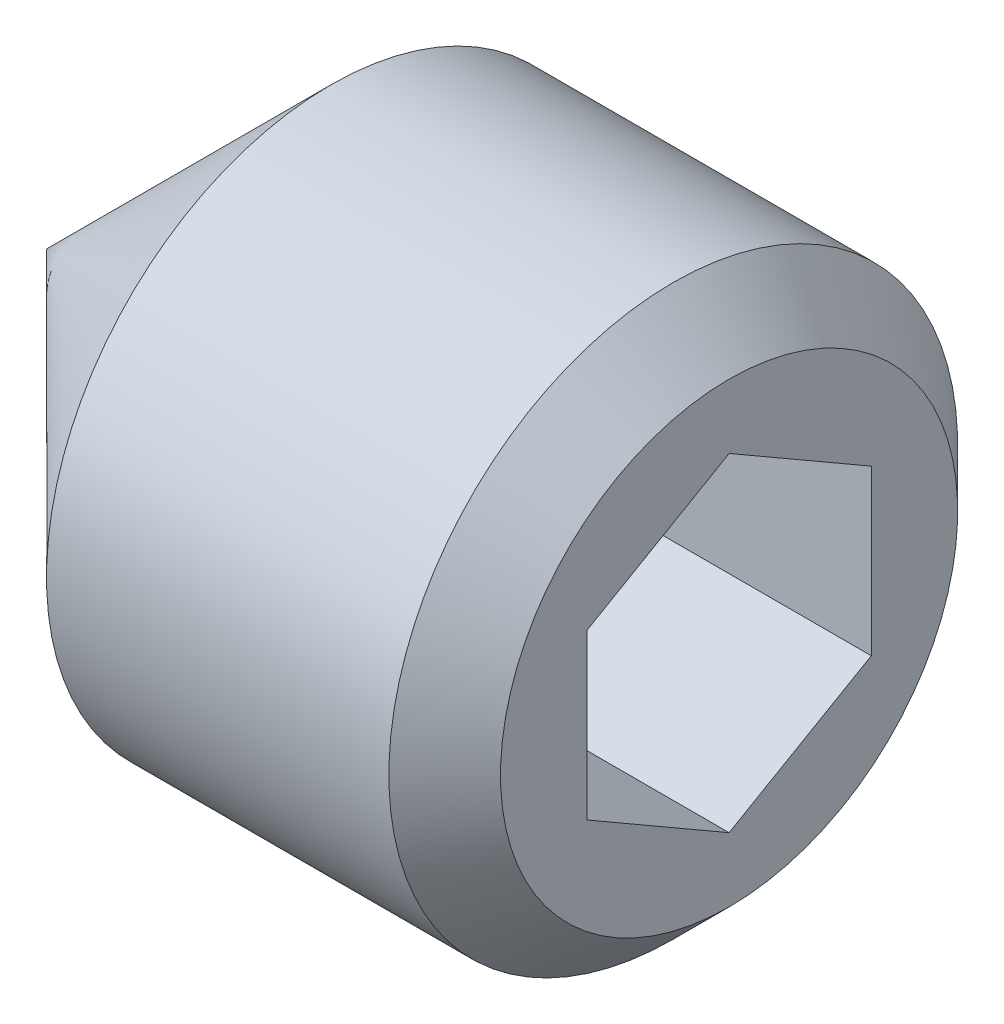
ISO-10303-21;
HEADER;
FILE_DESCRIPTION(('STEP AP214'),'2;1');
FILE_NAME('part.step','',(''),(''),'','','');
FILE_SCHEMA(('AUTOMOTIVE_DESIGN { 1 0 10303 214 1 1 1 1 }'));
ENDSEC;
DATA;
#1=APPLICATION_CONTEXT('core data for automotive mechanical design processes');
#2=APPLICATION_PROTOCOL_DEFINITION('international standard','automotive_design',2000,#1);
#3=PRODUCT_CONTEXT('',#1,'mechanical');
#4=PRODUCT('Part','Part','',(#3));
#5=PRODUCT_RELATED_PRODUCT_CATEGORY('part','',(#4));
#6=PRODUCT_DEFINITION_FORMATION('','',#4);
#7=PRODUCT_DEFINITION_CONTEXT('part definition',#1,'design');
#8=PRODUCT_DEFINITION('design','',#6,#7);
#9=PRODUCT_DEFINITION_SHAPE('','',#8);
#10=(LENGTH_UNIT() NAMED_UNIT(*) SI_UNIT(.MILLI.,.METRE.));
#11=(NAMED_UNIT(*) PLANE_ANGLE_UNIT() SI_UNIT($,.RADIAN.));
#12=(NAMED_UNIT(*) SI_UNIT($,.STERADIAN.) SOLID_ANGLE_UNIT());
#13=UNCERTAINTY_MEASURE_WITH_UNIT(LENGTH_MEASURE(1.E-05),#10,'distance_accuracy_value','');
#14=(GEOMETRIC_REPRESENTATION_CONTEXT(3) GLOBAL_UNCERTAINTY_ASSIGNED_CONTEXT((#13)) GLOBAL_UNIT_ASSIGNED_CONTEXT((#10,
#11,#12)) REPRESENTATION_CONTEXT('',''));
#15=CARTESIAN_POINT('',(0.,0.,0.));
#16=DIRECTION('',(0.,0.,1.));
#17=DIRECTION('',(1.,0.,0.));
#18=AXIS2_PLACEMENT_3D('',#15,#16,#17);
#19=CARTESIAN_POINT('',(5.99999999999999,-0.721687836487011,-1.25));
#20=DIRECTION('',(0.,0.,-1.));
#21=DIRECTION('',(-1.,0.,0.));
#22=AXIS2_PLACEMENT_3D('',#19,#20,#21);
#23=PLANE('',#22);
#24=DIRECTION('',(1.,0.,0.));
#25=VECTOR('',#24,1.);
#26=CARTESIAN_POINT('',(5.99999999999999,-0.721687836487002,-1.25000000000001));
#27=LINE('',#26,#25);
#28=CARTESIAN_POINT('',(3.00000000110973,-0.721687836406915,-1.24999999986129));
#29=VERTEX_POINT('',#28);
#30=CARTESIAN_POINT('',(5.99999999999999,-0.721687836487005,-1.25000000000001));
#31=VERTEX_POINT('',#30);
#32=EDGE_CURVE('E77',#29,#31,#27,.T.);
#33=ORIENTED_EDGE('',*,*,#32,.T.);
#34=DIRECTION('',(0.,1.,0.));
#35=VECTOR('',#34,1.);
#36=CARTESIAN_POINT('',(5.99999999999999,-0.721687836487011,-1.25));
#37=LINE('',#36,#35);
#38=CARTESIAN_POINT('',(5.99999999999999,0.721687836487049,-1.25));
#39=VERTEX_POINT('',#38);
#40=EDGE_CURVE('E83',#39,#31,#37,.F.);
#41=ORIENTED_EDGE('',*,*,#40,.F.);
#42=DIRECTION('',(1.,0.,0.));
#43=VECTOR('',#42,1.);
#44=CARTESIAN_POINT('',(5.99999999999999,0.721687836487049,-1.25));
#45=LINE('',#44,#43);
#46=CARTESIAN_POINT('',(3.00000000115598,0.721687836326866,-1.25));
#47=VERTEX_POINT('',#46);
#48=EDGE_CURVE('E80',#39,#47,#45,.F.);
#49=ORIENTED_EDGE('',*,*,#48,.T.);
#50=CARTESIAN_POINT('',(3.00000000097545,-0.72168783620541,-1.25000000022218));
#51=CARTESIAN_POINT('',(2.98168471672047,-0.658260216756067,-1.2500000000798));
#52=CARTESIAN_POINT('',(2.96502792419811,-0.594285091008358,-1.25000000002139));
#53=CARTESIAN_POINT('',(2.93595399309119,-0.465227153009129,-1.24999999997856));
#54=CARTESIAN_POINT('',(2.9235471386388,-0.400142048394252,-1.24999999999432));
#55=CARTESIAN_POINT('',(2.90423497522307,-0.270778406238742,-1.25000000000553));
#56=CARTESIAN_POINT('',(2.8972011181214,-0.206519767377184,-1.25000000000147));
#57=CARTESIAN_POINT('',(2.88880573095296,-0.0777002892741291,-1.24999999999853));
#58=CARTESIAN_POINT('',(2.88743724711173,-0.013139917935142,-1.24999999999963));
#59=CARTESIAN_POINT('',(2.89029143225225,0.107484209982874,-1.25000000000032));
#60=CARTESIAN_POINT('',(2.89381330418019,0.163566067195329,-1.25000000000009));
#61=CARTESIAN_POINT('',(2.90497331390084,0.275364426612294,-1.24999999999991));
#62=CARTESIAN_POINT('',(2.91261526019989,0.331080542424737,-1.24999999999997));
#63=CARTESIAN_POINT('',(2.93171864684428,0.4431092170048,-1.25000000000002));
#64=CARTESIAN_POINT('',(2.94326102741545,0.49940760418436,-1.25000000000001));
#65=CARTESIAN_POINT('',(2.96945735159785,0.611164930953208,-1.24999999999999));
#66=CARTESIAN_POINT('',(2.9841051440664,0.666625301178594,-1.24999999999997));
#67=CARTESIAN_POINT('',(3.00000000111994,0.72168783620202,-1.25));
#68=B_SPLINE_CURVE_WITH_KNOTS('',3,(#50,#51,#52,#53,#54,#55,#56,#57,#58,#59,#60,#61,#62,#63,#64,
#65,#66,#67),.UNSPECIFIED.,.F.,.F.,(4,2,2,2,2,2,2,2,4),(0.,0.198135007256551,0.396746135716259,
0.590442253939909,0.783900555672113,0.952317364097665,1.12089012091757,1.2932010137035,
1.46517373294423),.UNSPECIFIED.);
#69=EDGE_CURVE('E20',#29,#47,#68,.T.);
#70=ORIENTED_EDGE('',*,*,#69,.F.);
#71=EDGE_LOOP('',(#33,#41,#49,#70));
#72=FACE_BOUND('',#71,.T.);
#73=ADVANCED_FACE('F16',(#72),#23,.F.);
#74=CARTESIAN_POINT('',(5.99999999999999,-1.44337567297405,0.));
#75=DIRECTION('',(0.,-0.866025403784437,-0.500000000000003));
#76=DIRECTION('',(0.,0.500000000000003,-0.866025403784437));
#77=AXIS2_PLACEMENT_3D('',#74,#75,#76);
#78=PLANE('',#77);
#79=DIRECTION('',(1.,0.,0.));
#80=VECTOR('',#79,1.);
#81=CARTESIAN_POINT('',(5.99999999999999,-1.44337567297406,0.));
#82=LINE('',#81,#80);
#83=CARTESIAN_POINT('',(3.00000000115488,-1.44337567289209,-1.41983054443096E-10));
#84=VERTEX_POINT('',#83);
#85=CARTESIAN_POINT('',(5.99999999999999,-1.44337567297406,0.));
#86=VERTEX_POINT('',#85);
#87=EDGE_CURVE('E144',#84,#86,#82,.T.);
#88=ORIENTED_EDGE('',*,*,#87,.T.);
#89=DIRECTION('',(0.,0.500000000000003,-0.866025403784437));
#90=VECTOR('',#89,1.);
#91=CARTESIAN_POINT('',(5.99999999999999,-1.44337567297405,0.));
#92=LINE('',#91,#90);
#93=EDGE_CURVE('E93',#31,#86,#92,.F.);
#94=ORIENTED_EDGE('',*,*,#93,.F.);
#95=ORIENTED_EDGE('',*,*,#32,.F.);
#96=CARTESIAN_POINT('',(3.00000000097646,-1.4433756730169,-3.59620048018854E-10));
#97=CARTESIAN_POINT('',(2.98168471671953,-1.41166186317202,-0.0549299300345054));
#98=CARTESIAN_POINT('',(2.96502792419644,-1.3796743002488,-0.110334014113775));
#99=CARTESIAN_POINT('',(2.9359539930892,-1.3151453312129,-0.222101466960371));
#100=CARTESIAN_POINT('',(2.92354713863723,-1.28260277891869,-0.278466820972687));
#101=CARTESIAN_POINT('',(2.90423497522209,-1.21792095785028,-0.390499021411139));
#102=CARTESIAN_POINT('',(2.89720111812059,-1.18579163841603,-0.446148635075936));
#103=CARTESIAN_POINT('',(2.88880573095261,-1.12138189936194,-0.557709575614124));
#104=CARTESIAN_POINT('',(2.88743724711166,-1.08910171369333,-0.613620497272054));
#105=CARTESIAN_POINT('',(2.89029143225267,-1.02878964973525,-0.718084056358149));
#106=CARTESIAN_POINT('',(2.89381330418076,-1.0007487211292,-0.766652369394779));
#107=CARTESIAN_POINT('',(2.90497331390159,-0.944849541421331,-0.863472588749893));
#108=CARTESIAN_POINT('',(2.91261526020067,-0.916991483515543,-0.911724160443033));
#109=CARTESIAN_POINT('',(2.931718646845,-0.860977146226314,-1.00874383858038));
#110=CARTESIAN_POINT('',(2.94326102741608,-0.832827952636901,-1.05749967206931));
#111=CARTESIAN_POINT('',(2.96945735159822,-0.776949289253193,-1.15428435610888));
#112=CARTESIAN_POINT('',(2.9841051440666,-0.74921910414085,-1.20231444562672));
#113=CARTESIAN_POINT('',(3.00000000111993,-0.721687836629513,-1.24999999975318));
#114=B_SPLINE_CURVE_WITH_KNOTS('',3,(#96,#97,#98,#99,#100,#101,#102,#103,#104,#105,#106,#107,
#108,#109,#110,#111,#112,#113),.UNSPECIFIED.,.F.,.F.,(4,2,2,2,2,2,2,2,4),(0.,0.198135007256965,
0.396746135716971,0.59044225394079,0.78390055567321,0.95231736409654,1.12089012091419,
1.29320101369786,1.46517373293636),.UNSPECIFIED.);
#115=EDGE_CURVE('E85',#84,#29,#114,.T.);
#116=ORIENTED_EDGE('',*,*,#115,.F.);
#117=EDGE_LOOP('',(#88,#94,#95,#116));
#118=FACE_BOUND('',#117,.T.);
#119=ADVANCED_FACE('F94',(#118),#78,.F.);
#120=CARTESIAN_POINT('',(5.99999999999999,0.721687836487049,-1.25));
#121=DIRECTION('',(0.,0.86602540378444,-0.499999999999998));
#122=DIRECTION('',(0.,0.499999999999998,0.86602540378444));
#123=AXIS2_PLACEMENT_3D('',#120,#121,#122);
#124=PLANE('',#123);
#125=ORIENTED_EDGE('',*,*,#48,.F.);
#126=DIRECTION('',(0.,0.499999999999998,0.86602540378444));
#127=VECTOR('',#126,1.);
#128=CARTESIAN_POINT('',(5.99999999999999,0.721687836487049,-1.25));
#129=LINE('',#128,#127);
#130=CARTESIAN_POINT('',(5.99999999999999,1.44337567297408,0.));
#131=VERTEX_POINT('',#130);
#132=EDGE_CURVE('E92',#131,#39,#129,.F.);
#133=ORIENTED_EDGE('',*,*,#132,.F.);
#134=DIRECTION('',(1.,0.,0.));
#135=VECTOR('',#134,1.);
#136=CARTESIAN_POINT('',(5.99999999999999,1.44337567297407,0.));
#137=LINE('',#136,#135);
#138=CARTESIAN_POINT('',(3.00000000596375,1.44337568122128,1.42845824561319E-08));
#139=VERTEX_POINT('',#138);
#140=EDGE_CURVE('E189',#131,#139,#137,.F.);
#141=ORIENTED_EDGE('',*,*,#140,.T.);
#142=CARTESIAN_POINT('',(3.00000000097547,0.721687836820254,-1.24999999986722));
#143=CARTESIAN_POINT('',(2.98168471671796,0.753401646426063,-1.19507007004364));
#144=CARTESIAN_POINT('',(2.96502792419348,0.785389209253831,-1.13966598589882));
#145=CARTESIAN_POINT('',(2.93595399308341,0.849918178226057,-1.02789853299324));
#146=CARTESIAN_POINT('',(2.92354713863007,0.882460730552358,-0.971533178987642));
#147=CARTESIAN_POINT('',(2.90423497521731,0.947142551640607,-0.859500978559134));
#148=CARTESIAN_POINT('',(2.89720111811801,0.979271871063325,-0.803851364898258));
#149=CARTESIAN_POINT('',(2.88880573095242,1.04368161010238,-0.692290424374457));
#150=CARTESIAN_POINT('',(2.88743724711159,1.07596179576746,-0.636379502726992));
#151=CARTESIAN_POINT('',(2.89029143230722,1.13627386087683,-0.531915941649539));
#152=CARTESIAN_POINT('',(2.89381330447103,1.16431479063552,-0.483347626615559));
#153=CARTESIAN_POINT('',(2.90497331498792,1.22021397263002,-0.386527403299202));
#154=CARTESIAN_POINT('',(2.91261526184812,1.24807203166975,-0.338275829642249));
#155=CARTESIAN_POINT('',(2.93171864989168,1.30408637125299,-0.241256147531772));
#156=CARTESIAN_POINT('',(2.94326103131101,1.33223556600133,-0.19250031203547));
#157=CARTESIAN_POINT('',(2.96945735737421,1.38811423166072,-0.0957156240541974));
#158=CARTESIAN_POINT('',(2.98410515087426,1.41584441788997,-0.0476855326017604));
#159=CARTESIAN_POINT('',(3.00000000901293,1.44337568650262,2.34321214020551E-08));
#160=B_SPLINE_CURVE_WITH_KNOTS('',3,(#142,#143,#144,#145,#146,#147,#148,#149,#150,#151,#152,
#153,#154,#155,#156,#157,#158,#159),.UNSPECIFIED.,.F.,.F.,(4,2,2,2,2,2,2,2,4),(0.,
0.198135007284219,0.396746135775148,0.590442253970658,0.783900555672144,0.952317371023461,
1.12089013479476,1.29320103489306,1.46517376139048),.UNSPECIFIED.);
#161=EDGE_CURVE('E139',#47,#139,#160,.T.);
#162=ORIENTED_EDGE('',*,*,#161,.F.);
#163=EDGE_LOOP('',(#125,#133,#141,#162));
#164=FACE_BOUND('',#163,.T.);
#165=ADVANCED_FACE('F145',(#164),#124,.F.);
#166=CARTESIAN_POINT('',(5.99999999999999,-0.721687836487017,1.25));
#167=DIRECTION('',(0.,-0.86602540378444,0.499999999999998));
#168=DIRECTION('',(0.,-0.499999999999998,-0.86602540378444));
#169=AXIS2_PLACEMENT_3D('',#166,#167,#168);
#170=PLANE('',#169);
#171=DIRECTION('',(1.,0.,0.));
#172=VECTOR('',#171,1.);
#173=CARTESIAN_POINT('',(5.99999999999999,-0.721687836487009,1.25));
#174=LINE('',#173,#172);
#175=CARTESIAN_POINT('',(2.99999999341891,-0.721687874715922,1.24999996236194));
#176=VERTEX_POINT('',#175);
#177=CARTESIAN_POINT('',(5.99999999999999,-0.721687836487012,1.25));
#178=VERTEX_POINT('',#177);
#179=EDGE_CURVE('E197',#176,#178,#174,.T.);
#180=ORIENTED_EDGE('',*,*,#179,.T.);
#181=DIRECTION('',(0.,-0.499999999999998,-0.86602540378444));
#182=VECTOR('',#181,1.);
#183=CARTESIAN_POINT('',(5.99999999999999,-0.721687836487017,1.25));
#184=LINE('',#183,#182);
#185=EDGE_CURVE('E190',#86,#178,#184,.F.);
#186=ORIENTED_EDGE('',*,*,#185,.F.);
#187=ORIENTED_EDGE('',*,*,#87,.F.);
#188=CARTESIAN_POINT('',(3.00000000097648,-1.44337567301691,3.59576679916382E-10));
#189=CARTESIAN_POINT('',(2.98168471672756,-1.4116618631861,0.0549299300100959));
#190=CARTESIAN_POINT('',(2.96502792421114,-1.37967430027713,0.110334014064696));
#191=CARTESIAN_POINT('',(2.93595399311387,-1.31514533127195,0.222101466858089));
#192=CARTESIAN_POINT('',(2.92354713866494,-1.28260277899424,0.278466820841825));
#193=CARTESIAN_POINT('',(2.90423497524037,-1.21792095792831,0.390499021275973));
#194=CARTESIAN_POINT('',(2.89720111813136,-1.18579163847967,0.44614863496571));
#195=CARTESIAN_POINT('',(2.88880573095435,-1.12138189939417,0.557709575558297));
#196=CARTESIAN_POINT('',(2.88743724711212,-1.08910171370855,0.613620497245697));
#197=CARTESIAN_POINT('',(2.89029143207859,-1.0287896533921,0.718084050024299));
#198=CARTESIAN_POINT('',(2.89381330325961,-1.00074872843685,0.766652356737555));
#199=CARTESIAN_POINT('',(2.90497331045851,-0.944849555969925,0.863472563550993));
#200=CARTESIAN_POINT('',(2.91261525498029,-0.916991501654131,0.911724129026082));
#201=CARTESIAN_POINT('',(2.93171863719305,-0.86097717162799,1.00874379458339));
#202=CARTESIAN_POINT('',(2.94326101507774,-0.832827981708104,1.05749962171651));
#203=CARTESIAN_POINT('',(2.96945733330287,-0.776949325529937,1.15428429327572));
#204=CARTESIAN_POINT('',(2.98410512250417,-0.74921914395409,1.20231437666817));
#205=CARTESIAN_POINT('',(2.99999997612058,-0.721687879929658,1.24999992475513));
#206=B_SPLINE_CURVE_WITH_KNOTS('',3,(#188,#189,#190,#191,#192,#193,#194,#195,#196,#197,#198,
#199,#200,#201,#202,#203,#204,#205),.UNSPECIFIED.,.F.,.F.,(4,2,2,2,2,2,2,2,4),(0.,
0.198135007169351,0.396746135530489,0.590442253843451,0.783900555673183,0.952317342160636,
1.12089007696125,1.29320094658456,1.46517364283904),.UNSPECIFIED.);
#207=EDGE_CURVE('E88',#84,#176,#206,.T.);
#208=ORIENTED_EDGE('',*,*,#207,.T.);
#209=EDGE_LOOP('',(#180,#186,#187,#208));
#210=FACE_BOUND('',#209,.T.);
#211=ADVANCED_FACE('F148',(#210),#170,.F.);
#212=CARTESIAN_POINT('',(5.99999999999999,1.44337567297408,0.));
#213=DIRECTION('',(0.,0.866025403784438,0.500000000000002));
#214=DIRECTION('',(0.,-0.500000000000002,0.866025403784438));
#215=AXIS2_PLACEMENT_3D('',#212,#213,#214);
#216=PLANE('',#215);
#217=ORIENTED_EDGE('',*,*,#140,.F.);
#218=DIRECTION('',(0.,-0.500000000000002,0.866025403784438));
#219=VECTOR('',#218,1.);
#220=CARTESIAN_POINT('',(5.99999999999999,1.44337567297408,0.));
#221=LINE('',#220,#219);
#222=CARTESIAN_POINT('',(5.99999999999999,0.721687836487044,1.25));
#223=VERTEX_POINT('',#222);
#224=EDGE_CURVE('E180',#223,#131,#221,.F.);
#225=ORIENTED_EDGE('',*,*,#224,.F.);
#226=DIRECTION('',(1.,0.,0.));
#227=VECTOR('',#226,1.);
#228=CARTESIAN_POINT('',(5.99999999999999,0.721687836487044,1.25));
#229=LINE('',#228,#227);
#230=CARTESIAN_POINT('',(2.9999999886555,0.72168785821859,1.24999996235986));
#231=VERTEX_POINT('',#230);
#232=EDGE_CURVE('E111',#223,#231,#229,.F.);
#233=ORIENTED_EDGE('',*,*,#232,.T.);
#234=CARTESIAN_POINT('',(2.99999997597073,0.72168788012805,1.24999992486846));
#235=CARTESIAN_POINT('',(2.98168469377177,0.753401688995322,1.19506999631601));
#236=CARTESIAN_POINT('',(2.96502790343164,0.785389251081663,1.13966591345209));
#237=CARTESIAN_POINT('',(2.93595397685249,0.849918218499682,1.02789846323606));
#238=CARTESIAN_POINT('',(2.9235471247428,0.882460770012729,0.971533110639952));
#239=CARTESIAN_POINT('',(2.90423496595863,0.947142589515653,0.859500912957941));
#240=CARTESIAN_POINT('',(2.89720111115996,0.979271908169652,0.803851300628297));
#241=CARTESIAN_POINT('',(2.88880572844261,1.04368164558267,0.69229036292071));
#242=CARTESIAN_POINT('',(2.88743724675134,1.07596183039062,0.63637944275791));
#243=CARTESIAN_POINT('',(2.89029143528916,1.13627388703,0.531915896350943));
#244=CARTESIAN_POINT('',(2.89381330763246,1.1643148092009,0.483347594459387));
#245=CARTESIAN_POINT('',(2.90497331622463,1.22021397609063,0.386527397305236));
#246=CARTESIAN_POINT('',(2.91261526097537,1.24807202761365,0.338275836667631));
#247=CARTESIAN_POINT('',(2.9317186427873,1.30408635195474,0.241256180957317));
#248=CARTESIAN_POINT('',(2.94326102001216,1.33223553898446,0.192500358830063));
#249=CARTESIAN_POINT('',(2.96945733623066,1.38811418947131,0.0957156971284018));
#250=CARTESIAN_POINT('',(2.98410512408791,1.41584436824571,0.04768561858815));
#251=CARTESIAN_POINT('',(2.9999999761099,1.4433756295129,7.52769787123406E-08));
#252=B_SPLINE_CURVE_WITH_KNOTS('',3,(#234,#235,#236,#237,#238,#239,#240,#241,#242,#243,#244,
#245,#246,#247,#248,#249,#250,#251),.UNSPECIFIED.,.F.,.F.,(4,2,2,2,2,2,2,2,4),(0.,
0.198135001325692,0.396746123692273,0.590442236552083,0.78390053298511,0.952317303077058,
1.12089002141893,1.2932008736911,1.46517355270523),.UNSPECIFIED.);
#253=EDGE_CURVE('E135',#231,#139,#252,.T.);
#254=ORIENTED_EDGE('',*,*,#253,.T.);
#255=EDGE_LOOP('',(#217,#225,#233,#254));
#256=FACE_BOUND('',#255,.T.);
#257=ADVANCED_FACE('F123',(#256),#216,.F.);
#258=CARTESIAN_POINT('',(3.00500000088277,0.,0.));
#259=DIRECTION('',(1.,0.,0.));
#260=DIRECTION('',(0.,0.,-1.));
#261=AXIS2_PLACEMENT_3D('',#258,#259,#260);
#262=CONICAL_SURFACE('',#261,1.45203592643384,1.04719754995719);
#263=CARTESIAN_POINT('',(2.16666666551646,-5.6843418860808E-11,0.));
#264=VERTEX_POINT('',#263);
#265=VERTEX_LOOP('',#264);
#266=FACE_BOUND('',#265,.T.);
#267=ORIENTED_EDGE('',*,*,#207,.F.);
#268=ORIENTED_EDGE('',*,*,#115,.T.);
#269=ORIENTED_EDGE('',*,*,#69,.T.);
#270=ORIENTED_EDGE('',*,*,#161,.T.);
#271=ORIENTED_EDGE('',*,*,#253,.F.);
#272=CARTESIAN_POINT('',(3.00000003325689,0.72168786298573,1.24999996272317));
#273=CARTESIAN_POINT('',(2.98168473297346,0.658260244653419,1.24999998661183));
#274=CARTESIAN_POINT('',(2.96502793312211,0.59428511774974,1.24999999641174));
#275=CARTESIAN_POINT('',(2.93595399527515,0.465227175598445,1.25000000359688));
#276=CARTESIAN_POINT('',(2.92354714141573,0.400142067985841,1.2500000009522));
#277=CARTESIAN_POINT('',(2.90423497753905,0.270778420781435,1.24999999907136));
#278=CARTESIAN_POINT('',(2.89720111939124,0.206519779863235,1.24999999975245));
#279=CARTESIAN_POINT('',(2.88880573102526,0.077700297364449,1.25000000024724));
#280=CARTESIAN_POINT('',(2.88743724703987,0.0131399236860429,1.250000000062));
#281=CARTESIAN_POINT('',(2.89029143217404,-0.107484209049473,1.24999999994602));
#282=CARTESIAN_POINT('',(2.89381330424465,-0.163566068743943,1.24999999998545));
#283=CARTESIAN_POINT('',(2.90497331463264,-0.27536443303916,1.25000000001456));
#284=CARTESIAN_POINT('',(2.91261526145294,-0.331080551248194,1.2500000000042));
#285=CARTESIAN_POINT('',(2.93171864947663,-0.443109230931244,1.24999999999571));
#286=CARTESIAN_POINT('',(2.94326103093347,-0.499407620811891,1.24999999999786));
#287=CARTESIAN_POINT('',(2.96945735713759,-0.611164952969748,1.25000000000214));
#288=CARTESIAN_POINT('',(2.9841051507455,-0.666625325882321,1.25000000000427));
#289=CARTESIAN_POINT('',(3.00000000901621,-0.721687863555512,1.25));
#290=B_SPLINE_CURVE_WITH_KNOTS('',3,(#272,#273,#274,#275,#276,#277,#278,#279,#280,#281,#282,
#283,#284,#285,#286,#287,#288,#289),.UNSPECIFIED.,.F.,.F.,(4,2,2,2,2,2,2,2,4),(0.,
0.198135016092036,0.396746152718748,0.590442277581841,0.783900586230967,0.952317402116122,
1.12089016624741,1.29320106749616,1.46517379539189),.UNSPECIFIED.);
#291=EDGE_CURVE('E105',#231,#176,#290,.T.);
#292=ORIENTED_EDGE('',*,*,#291,.T.);
#293=EDGE_LOOP('',(#267,#268,#269,#270,#271,#292));
#294=FACE_BOUND('',#293,.T.);
#295=ADVANCED_FACE('F86',(#266,#294),#262,.F.);
#296=CARTESIAN_POINT('',(5.99999999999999,0.721687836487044,1.25));
#297=DIRECTION('',(0.,0.,1.));
#298=DIRECTION('',(1.,0.,0.));
#299=AXIS2_PLACEMENT_3D('',#296,#297,#298);
#300=PLANE('',#299);
#301=ORIENTED_EDGE('',*,*,#232,.F.);
#302=DIRECTION('',(0.,1.,0.));
#303=VECTOR('',#302,1.);
#304=CARTESIAN_POINT('',(5.99999999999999,0.,1.25));
#305=LINE('',#304,#303);
#306=EDGE_CURVE('E104',#223,#178,#305,.F.);
#307=ORIENTED_EDGE('',*,*,#306,.T.);
#308=ORIENTED_EDGE('',*,*,#179,.F.);
#309=ORIENTED_EDGE('',*,*,#291,.F.);
#310=EDGE_LOOP('',(#301,#307,#308,#309));
#311=FACE_BOUND('',#310,.T.);
#312=ADVANCED_FACE('F117',(#311),#300,.F.);
#313=CARTESIAN_POINT('',(5.99999999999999,0.,0.));
#314=DIRECTION('',(-1.,0.,0.));
#315=DIRECTION('',(0.,0.,1.));
#316=AXIS2_PLACEMENT_3D('',#313,#314,#315);
#317=PLANE('',#316);
#318=ORIENTED_EDGE('',*,*,#224,.T.);
#319=ORIENTED_EDGE('',*,*,#132,.T.);
#320=ORIENTED_EDGE('',*,*,#40,.T.);
#321=ORIENTED_EDGE('',*,*,#93,.T.);
#322=ORIENTED_EDGE('',*,*,#185,.T.);
#323=ORIENTED_EDGE('',*,*,#306,.F.);
#324=EDGE_LOOP('',(#318,#319,#320,#321,#322,#323));
#325=FACE_BOUND('',#324,.T.);
#326=CARTESIAN_POINT('',(6.00000000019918,0.,0.));
#327=DIRECTION('',(-1.,0.,0.));
#328=DIRECTION('',(0.,-1.,0.));
#329=AXIS2_PLACEMENT_3D('',#326,#327,#328);
#330=CIRCLE('',#329,2.0092400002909);
#331=CARTESIAN_POINT('',(6.00000000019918,-2.0092400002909,0.));
#332=VERTEX_POINT('',#331);
#333=EDGE_CURVE('E101',#332,#332,#330,.T.);
#334=ORIENTED_EDGE('',*,*,#333,.F.);
#335=EDGE_LOOP('',(#334));
#336=FACE_BOUND('',#335,.T.);
#337=ADVANCED_FACE('F171',(#325,#336),#317,.F.);
#338=CARTESIAN_POINT('',(2.4999950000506,0.,0.));
#339=DIRECTION('',(1.,0.,0.));
#340=DIRECTION('',(0.,1.,0.));
#341=AXIS2_PLACEMENT_3D('',#338,#339,#340);
#342=CONICAL_SURFACE('',#341,2.50000000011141,0.785399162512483);
#343=CARTESIAN_POINT('',(-4.43378667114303E-09,5.6843418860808E-11,0.));
#344=VERTEX_POINT('',#343);
#345=VERTEX_LOOP('',#344);
#346=FACE_BOUND('',#345,.T.);
#347=CARTESIAN_POINT('',(2.499995,0.,0.));
#348=DIRECTION('',(1.,0.,0.));
#349=DIRECTION('',(0.,1.,0.));
#350=AXIS2_PLACEMENT_3D('',#347,#348,#349);
#351=CIRCLE('',#350,2.5);
#352=CARTESIAN_POINT('',(2.499995,2.5,0.));
#353=VERTEX_POINT('',#352);
#354=EDGE_CURVE('E30',#353,#353,#351,.T.);
#355=ORIENTED_EDGE('',*,*,#354,.F.);
#356=EDGE_LOOP('',(#355));
#357=FACE_BOUND('',#356,.T.);
#358=ADVANCED_FACE('F165',(#346,#357),#342,.T.);
#359=CARTESIAN_POINT('',(5.50923999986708,0.,0.));
#360=DIRECTION('',(-1.,0.,0.));
#361=DIRECTION('',(0.,-1.,0.));
#362=AXIS2_PLACEMENT_3D('',#359,#360,#361);
#363=CONICAL_SURFACE('',#362,2.49999999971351,0.78539816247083);
#364=ORIENTED_EDGE('',*,*,#333,.T.);
#365=EDGE_LOOP('',(#364));
#366=FACE_BOUND('',#365,.T.);
#367=CARTESIAN_POINT('',(5.50923999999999,0.,0.));
#368=DIRECTION('',(1.,0.,0.));
#369=DIRECTION('',(0.,1.,0.));
#370=AXIS2_PLACEMENT_3D('',#367,#368,#369);
#371=CIRCLE('',#370,2.5);
#372=CARTESIAN_POINT('',(5.50923999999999,2.5,0.));
#373=VERTEX_POINT('',#372);
#374=EDGE_CURVE('E11',#373,#373,#371,.F.);
#375=ORIENTED_EDGE('',*,*,#374,.F.);
#376=EDGE_LOOP('',(#375));
#377=FACE_BOUND('',#376,.T.);
#378=ADVANCED_FACE('F159',(#366,#377),#363,.T.);
#379=CARTESIAN_POINT('',(2.99999999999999,0.,0.));
#380=DIRECTION('',(1.,0.,0.));
#381=DIRECTION('',(0.,1.,0.));
#382=AXIS2_PLACEMENT_3D('',#379,#380,#381);
#383=CYLINDRICAL_SURFACE('',#382,2.5);
#384=ORIENTED_EDGE('',*,*,#374,.T.);
#385=EDGE_LOOP('',(#384));
#386=FACE_BOUND('',#385,.T.);
#387=ORIENTED_EDGE('',*,*,#354,.T.);
#388=EDGE_LOOP('',(#387));
#389=FACE_BOUND('',#388,.T.);
#390=ADVANCED_FACE('F157',(#386,#389),#383,.T.);
#391=CLOSED_SHELL('',(#73,#119,#165,#211,#257,#295,#312,#337,#358,#378,#390));
#392=MANIFOLD_SOLID_BREP('B1',#391);
#393=ADVANCED_BREP_SHAPE_REPRESENTATION('',(#18,#392),#14);
#394=SHAPE_DEFINITION_REPRESENTATION(#9,#393);
ENDSEC;
END-ISO-10303-21;
